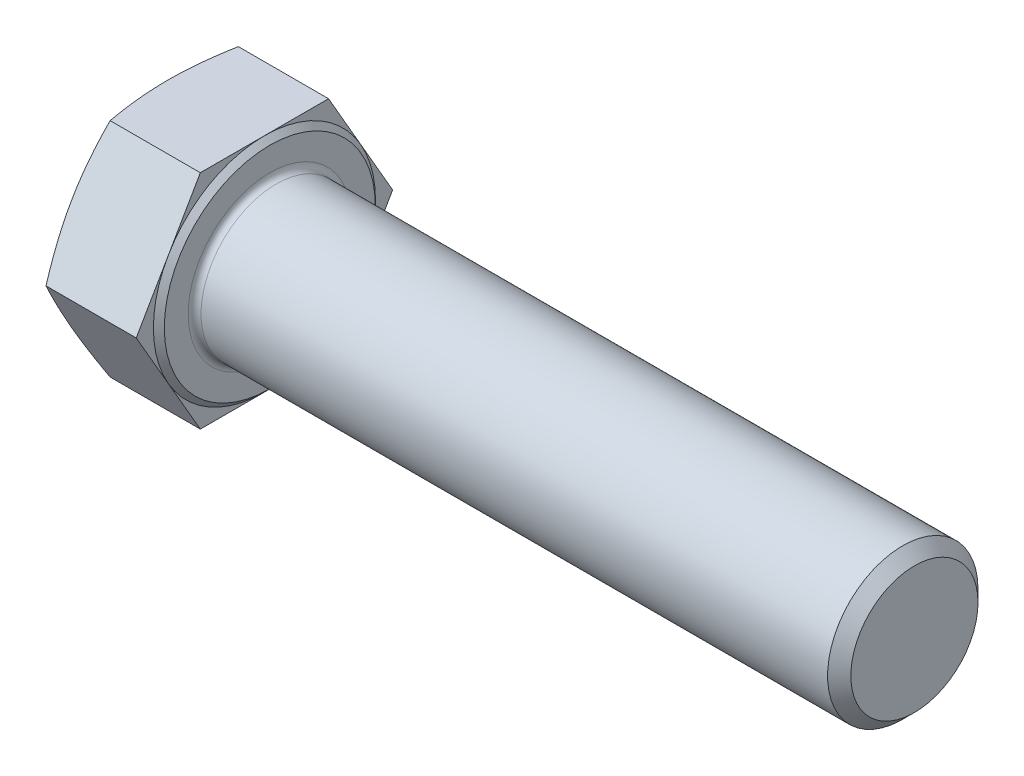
ISO-10303-21;
HEADER;
FILE_DESCRIPTION(('STEP AP214'),'2;1');
FILE_NAME('part.step','',(''),(''),'','','');
FILE_SCHEMA(('AUTOMOTIVE_DESIGN { 1 0 10303 214 1 1 1 1 }'));
ENDSEC;
DATA;
#1=APPLICATION_CONTEXT('core data for automotive mechanical design processes');
#2=APPLICATION_PROTOCOL_DEFINITION('international standard','automotive_design',2000,#1);
#3=PRODUCT_CONTEXT('',#1,'mechanical');
#4=PRODUCT('Part','Part','',(#3));
#5=PRODUCT_RELATED_PRODUCT_CATEGORY('part','',(#4));
#6=PRODUCT_DEFINITION_FORMATION('','',#4);
#7=PRODUCT_DEFINITION_CONTEXT('part definition',#1,'design');
#8=PRODUCT_DEFINITION('design','',#6,#7);
#9=PRODUCT_DEFINITION_SHAPE('','',#8);
#10=(LENGTH_UNIT() NAMED_UNIT(*) SI_UNIT(.MILLI.,.METRE.));
#11=(NAMED_UNIT(*) PLANE_ANGLE_UNIT() SI_UNIT($,.RADIAN.));
#12=(NAMED_UNIT(*) SI_UNIT($,.STERADIAN.) SOLID_ANGLE_UNIT());
#13=UNCERTAINTY_MEASURE_WITH_UNIT(LENGTH_MEASURE(1.E-05),#10,'distance_accuracy_value','');
#14=(GEOMETRIC_REPRESENTATION_CONTEXT(3) GLOBAL_UNCERTAINTY_ASSIGNED_CONTEXT((#13)) GLOBAL_UNIT_ASSIGNED_CONTEXT((#10,
#11,#12)) REPRESENTATION_CONTEXT('',''));
#15=CARTESIAN_POINT('',(0.,0.,0.));
#16=DIRECTION('',(0.,0.,1.));
#17=DIRECTION('',(1.,0.,0.));
#18=AXIS2_PLACEMENT_3D('',#15,#16,#17);
#19=CARTESIAN_POINT('',(9.48,0.,0.));
#20=DIRECTION('',(1.,0.,0.));
#21=DIRECTION('',(0.,0.,-1.));
#22=AXIS2_PLACEMENT_3D('',#19,#20,#21);
#23=PLANE('',#22);
#24=CARTESIAN_POINT('',(9.48,0.,0.));
#25=DIRECTION('',(1.,0.,0.));
#26=DIRECTION('',(0.,0.,-1.));
#27=AXIS2_PLACEMENT_3D('',#24,#25,#26);
#28=CIRCLE('',#27,7.6);
#29=CARTESIAN_POINT('',(9.48,0.,-7.6));
#30=VERTEX_POINT('',#29);
#31=EDGE_CURVE('E188',#30,#30,#28,.F.);
#32=ORIENTED_EDGE('',*,*,#31,.T.);
#33=EDGE_LOOP('',(#32));
#34=FACE_BOUND('',#33,.T.);
#35=CARTESIAN_POINT('',(9.48000000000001,0.,0.));
#36=DIRECTION('',(-1.,0.,0.));
#37=DIRECTION('',(0.,0.,1.));
#38=AXIS2_PLACEMENT_3D('',#35,#36,#37);
#39=CIRCLE('',#38,9.82);
#40=CARTESIAN_POINT('',(9.48000000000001,0.,9.82));
#41=VERTEX_POINT('',#40);
#42=EDGE_CURVE('E138',#41,#41,#39,.T.);
#43=ORIENTED_EDGE('',*,*,#42,.F.);
#44=EDGE_LOOP('',(#43));
#45=FACE_BOUND('',#44,.T.);
#46=ADVANCED_FACE('F33',(#34,#45),#23,.T.);
#47=CARTESIAN_POINT('',(8.98,-20.67,0.));
#48=DIRECTION('',(-1.,0.,0.));
#49=DIRECTION('',(0.,0.,1.));
#50=AXIS2_PLACEMENT_3D('',#47,#48,#49);
#51=PLANE('',#50);
#52=DIRECTION('',(0.,-0.866025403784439,0.5));
#53=VECTOR('',#52,1.);
#54=CARTESIAN_POINT('',(8.98,10.335,5.96691503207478));
#55=LINE('',#54,#53);
#56=CARTESIAN_POINT('',(8.98,10.335,5.96691503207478));
#57=VERTEX_POINT('',#56);
#58=CARTESIAN_POINT('',(8.98,5.1675,8.95037254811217));
#59=VERTEX_POINT('',#58);
#60=EDGE_CURVE('E137',#57,#59,#55,.T.);
#61=ORIENTED_EDGE('',*,*,#60,.T.);
#62=CARTESIAN_POINT('',(8.98,0.,0.));
#63=DIRECTION('',(-1.,0.,0.));
#64=DIRECTION('',(0.,0.,1.));
#65=AXIS2_PLACEMENT_3D('',#62,#63,#64);
#66=CIRCLE('',#65,10.335);
#67=CARTESIAN_POINT('',(8.98,10.335,0.));
#68=VERTEX_POINT('',#67);
#69=EDGE_CURVE('E49',#59,#68,#66,.T.);
#70=ORIENTED_EDGE('',*,*,#69,.T.);
#71=DIRECTION('',(0.,0.,1.));
#72=VECTOR('',#71,1.);
#73=CARTESIAN_POINT('',(8.98,10.335,-5.96691503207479));
#74=LINE('',#73,#72);
#75=EDGE_CURVE('E134',#68,#57,#74,.T.);
#76=ORIENTED_EDGE('',*,*,#75,.T.);
#77=EDGE_LOOP('',(#61,#70,#76));
#78=FACE_BOUND('',#77,.T.);
#79=ADVANCED_FACE('F133',(#78),#51,.F.);
#80=CARTESIAN_POINT('',(8.98,10.335,-5.96691503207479));
#81=VERTEX_POINT('',#80);
#82=EDGE_CURVE('E145',#81,#68,#74,.T.);
#83=ORIENTED_EDGE('',*,*,#82,.T.);
#84=CARTESIAN_POINT('',(8.98,5.1675,-8.95037254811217));
#85=VERTEX_POINT('',#84);
#86=EDGE_CURVE('E121',#68,#85,#66,.T.);
#87=ORIENTED_EDGE('',*,*,#86,.T.);
#88=DIRECTION('',(0.,0.866025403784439,0.5));
#89=VECTOR('',#88,1.);
#90=CARTESIAN_POINT('',(8.98,0.,-11.9338300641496));
#91=LINE('',#90,#89);
#92=EDGE_CURVE('E151',#85,#81,#91,.T.);
#93=ORIENTED_EDGE('',*,*,#92,.T.);
#94=EDGE_LOOP('',(#83,#87,#93));
#95=FACE_BOUND('',#94,.T.);
#96=ADVANCED_FACE('F150',(#95),#51,.F.);
#97=CARTESIAN_POINT('',(8.98,0.,-11.9338300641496));
#98=VERTEX_POINT('',#97);
#99=EDGE_CURVE('E148',#98,#85,#91,.T.);
#100=ORIENTED_EDGE('',*,*,#99,.T.);
#101=CARTESIAN_POINT('',(8.98,-5.1675,-8.95037254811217));
#102=VERTEX_POINT('',#101);
#103=EDGE_CURVE('E124',#85,#102,#66,.T.);
#104=ORIENTED_EDGE('',*,*,#103,.T.);
#105=DIRECTION('',(0.,0.866025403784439,-0.5));
#106=VECTOR('',#105,1.);
#107=CARTESIAN_POINT('',(8.98,-10.335,-5.96691503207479));
#108=LINE('',#107,#106);
#109=EDGE_CURVE('E348',#102,#98,#108,.T.);
#110=ORIENTED_EDGE('',*,*,#109,.T.);
#111=EDGE_LOOP('',(#100,#104,#110));
#112=FACE_BOUND('',#111,.T.);
#113=ADVANCED_FACE('F302',(#112),#51,.F.);
#114=CARTESIAN_POINT('',(8.98,-10.335,-5.96691503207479));
#115=VERTEX_POINT('',#114);
#116=EDGE_CURVE('E316',#115,#102,#108,.T.);
#117=ORIENTED_EDGE('',*,*,#116,.T.);
#118=CARTESIAN_POINT('',(8.98,-10.335,0.));
#119=VERTEX_POINT('',#118);
#120=EDGE_CURVE('E317',#102,#119,#66,.T.);
#121=ORIENTED_EDGE('',*,*,#120,.T.);
#122=DIRECTION('',(0.,0.,-1.));
#123=VECTOR('',#122,1.);
#124=CARTESIAN_POINT('',(8.98,-10.335,5.96691503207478));
#125=LINE('',#124,#123);
#126=EDGE_CURVE('E162',#119,#115,#125,.T.);
#127=ORIENTED_EDGE('',*,*,#126,.T.);
#128=EDGE_LOOP('',(#117,#121,#127));
#129=FACE_BOUND('',#128,.T.);
#130=ADVANCED_FACE('F295',(#129),#51,.F.);
#131=CARTESIAN_POINT('',(8.98,-10.335,5.96691503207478));
#132=VERTEX_POINT('',#131);
#133=EDGE_CURVE('E163',#132,#119,#125,.T.);
#134=ORIENTED_EDGE('',*,*,#133,.T.);
#135=CARTESIAN_POINT('',(8.98,-5.16750000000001,8.95037254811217));
#136=VERTEX_POINT('',#135);
#137=EDGE_CURVE('E306',#119,#136,#66,.T.);
#138=ORIENTED_EDGE('',*,*,#137,.T.);
#139=DIRECTION('',(0.,-0.866025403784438,-0.5));
#140=VECTOR('',#139,1.);
#141=CARTESIAN_POINT('',(8.98,0.,11.9338300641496));
#142=LINE('',#141,#140);
#143=EDGE_CURVE('E158',#136,#132,#142,.T.);
#144=ORIENTED_EDGE('',*,*,#143,.T.);
#145=EDGE_LOOP('',(#134,#138,#144));
#146=FACE_BOUND('',#145,.T.);
#147=ADVANCED_FACE('F287',(#146),#51,.F.);
#148=CARTESIAN_POINT('',(8.98,-10.335,-5.96691503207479));
#149=DIRECTION('',(0.,0.5,0.866025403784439));
#150=DIRECTION('',(0.,-0.866025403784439,0.5));
#151=AXIS2_PLACEMENT_3D('',#148,#149,#150);
#152=PLANE('',#151);
#153=CARTESIAN_POINT('',(0.581968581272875,0.000200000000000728,-11.9339455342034));
#154=CARTESIAN_POINT('',(0.491994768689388,-0.427811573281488,-11.6868329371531));
#155=CARTESIAN_POINT('',(0.410148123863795,-0.857234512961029,-11.4389054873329));
#156=CARTESIAN_POINT('',(0.266151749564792,-1.7188724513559,-10.9414385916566));
#157=CARTESIAN_POINT('',(0.204017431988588,-2.15108936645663,-10.6918980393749));
#158=CARTESIAN_POINT('',(0.103517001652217,-3.01351880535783,-10.1939741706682));
#159=CARTESIAN_POINT('',(0.0649316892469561,-3.44371163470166,-9.94560222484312));
#160=CARTESIAN_POINT('',(0.0131779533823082,-4.30510326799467,-9.44827753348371));
#161=CARTESIAN_POINT('',(0.,-4.73630163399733,-9.19932504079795));
#162=CARTESIAN_POINT('',(0.,-5.59869836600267,-8.70142005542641));
#163=CARTESIAN_POINT('',(0.0131779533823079,-6.02989673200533,-8.45246756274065));
#164=CARTESIAN_POINT('',(0.0649316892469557,-6.89128836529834,-7.95514287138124));
#165=CARTESIAN_POINT('',(0.103517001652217,-7.32148119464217,-7.70677092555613));
#166=CARTESIAN_POINT('',(0.204017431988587,-8.18391063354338,-7.20884705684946));
#167=CARTESIAN_POINT('',(0.266151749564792,-8.61612754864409,-6.95930650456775));
#168=CARTESIAN_POINT('',(0.410148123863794,-9.47776548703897,-6.46183960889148));
#169=CARTESIAN_POINT('',(0.491994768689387,-9.90718842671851,-6.21391215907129));
#170=CARTESIAN_POINT('',(0.581968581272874,-10.3352,-5.96679956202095));
#171=B_SPLINE_CURVE_WITH_KNOTS('',3,(#153,#154,#155,#156,#157,#158,#159,#160,#161,#162,#163,
#164,#165,#166,#167,#168,#169,#170),.UNSPECIFIED.,.F.,.F.,(4,2,2,2,2,2,2,2,4),(0.,
1.50720038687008,3.01557627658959,4.50968874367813,6.00324068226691,7.49679262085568,
8.99090508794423,10.4992809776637,12.0064813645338),.UNSPECIFIED.);
#172=CARTESIAN_POINT('',(0.581926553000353,0.,-11.9338300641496));
#173=VERTEX_POINT('',#172);
#174=CARTESIAN_POINT('',(0.,-5.1675,-8.95037254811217));
#175=VERTEX_POINT('',#174);
#176=EDGE_CURVE('E332',#173,#175,#171,.T.);
#177=ORIENTED_EDGE('',*,*,#176,.F.);
#178=DIRECTION('',(-1.,0.,0.));
#179=VECTOR('',#178,1.);
#180=CARTESIAN_POINT('',(8.98,0.,-11.9338300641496));
#181=LINE('',#180,#179);
#182=EDGE_CURVE('E178',#98,#173,#181,.T.);
#183=ORIENTED_EDGE('',*,*,#182,.F.);
#184=ORIENTED_EDGE('',*,*,#109,.F.);
#185=ORIENTED_EDGE('',*,*,#116,.F.);
#186=DIRECTION('',(-1.,0.,0.));
#187=VECTOR('',#186,1.);
#188=CARTESIAN_POINT('',(8.98,-10.335,-5.96691503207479));
#189=LINE('',#188,#187);
#190=CARTESIAN_POINT('',(0.581926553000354,-10.335,-5.9669150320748));
#191=VERTEX_POINT('',#190);
#192=EDGE_CURVE('E166',#115,#191,#189,.T.);
#193=ORIENTED_EDGE('',*,*,#192,.T.);
#194=EDGE_CURVE('E245',#175,#191,#171,.T.);
#195=ORIENTED_EDGE('',*,*,#194,.F.);
#196=EDGE_LOOP('',(#177,#183,#184,#185,#193,#195));
#197=FACE_BOUND('',#196,.T.);
#198=ADVANCED_FACE('F35',(#197),#152,.F.);
#199=CARTESIAN_POINT('',(8.98,0.,-11.9338300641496));
#200=DIRECTION('',(0.,-0.5,0.866025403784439));
#201=DIRECTION('',(0.,-0.866025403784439,-0.5));
#202=AXIS2_PLACEMENT_3D('',#199,#200,#201);
#203=PLANE('',#202);
#204=CARTESIAN_POINT('',(0.581968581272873,10.3352,-5.96679956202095));
#205=CARTESIAN_POINT('',(0.491994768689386,9.90718842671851,-6.21391215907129));
#206=CARTESIAN_POINT('',(0.410148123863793,9.47776548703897,-6.46183960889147));
#207=CARTESIAN_POINT('',(0.266151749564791,8.61612754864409,-6.95930650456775));
#208=CARTESIAN_POINT('',(0.204017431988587,8.18391063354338,-7.20884705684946));
#209=CARTESIAN_POINT('',(0.103517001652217,7.32148119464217,-7.70677092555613));
#210=CARTESIAN_POINT('',(0.0649316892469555,6.89128836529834,-7.95514287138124));
#211=CARTESIAN_POINT('',(0.0131779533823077,6.02989673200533,-8.45246756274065));
#212=CARTESIAN_POINT('',(0.,5.59869836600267,-8.70142005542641));
#213=CARTESIAN_POINT('',(0.,4.73630163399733,-9.19932504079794));
#214=CARTESIAN_POINT('',(0.0131779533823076,4.30510326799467,-9.44827753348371));
#215=CARTESIAN_POINT('',(0.0649316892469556,3.44371163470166,-9.94560222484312));
#216=CARTESIAN_POINT('',(0.103517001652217,3.01351880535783,-10.1939741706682));
#217=CARTESIAN_POINT('',(0.204017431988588,2.15108936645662,-10.6918980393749));
#218=CARTESIAN_POINT('',(0.266151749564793,1.7188724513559,-10.9414385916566));
#219=CARTESIAN_POINT('',(0.410148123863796,0.857234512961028,-11.4389054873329));
#220=CARTESIAN_POINT('',(0.491994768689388,0.427811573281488,-11.6868329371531));
#221=CARTESIAN_POINT('',(0.581968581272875,-0.000200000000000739,-11.9339455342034));
#222=B_SPLINE_CURVE_WITH_KNOTS('',3,(#204,#205,#206,#207,#208,#209,#210,#211,#212,#213,#214,
#215,#216,#217,#218,#219,#220,#221),.UNSPECIFIED.,.F.,.F.,(4,2,2,2,2,2,2,2,4),(0.,
1.50720038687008,3.01557627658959,4.50968874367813,6.00324068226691,7.49679262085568,
8.99090508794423,10.4992809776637,12.0064813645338),.UNSPECIFIED.);
#223=CARTESIAN_POINT('',(0.581926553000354,10.335,-5.9669150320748));
#224=VERTEX_POINT('',#223);
#225=CARTESIAN_POINT('',(0.,5.16750000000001,-8.95037254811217));
#226=VERTEX_POINT('',#225);
#227=EDGE_CURVE('E260',#224,#226,#222,.T.);
#228=ORIENTED_EDGE('',*,*,#227,.F.);
#229=DIRECTION('',(-1.,0.,0.));
#230=VECTOR('',#229,1.);
#231=CARTESIAN_POINT('',(8.98,10.335,-5.96691503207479));
#232=LINE('',#231,#230);
#233=EDGE_CURVE('E176',#81,#224,#232,.T.);
#234=ORIENTED_EDGE('',*,*,#233,.F.);
#235=ORIENTED_EDGE('',*,*,#92,.F.);
#236=ORIENTED_EDGE('',*,*,#99,.F.);
#237=ORIENTED_EDGE('',*,*,#182,.T.);
#238=EDGE_CURVE('E256',#226,#173,#222,.T.);
#239=ORIENTED_EDGE('',*,*,#238,.F.);
#240=EDGE_LOOP('',(#228,#234,#235,#236,#237,#239));
#241=FACE_BOUND('',#240,.T.);
#242=ADVANCED_FACE('F266',(#241),#203,.F.);
#243=CARTESIAN_POINT('',(8.98,10.335,-5.96691503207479));
#244=DIRECTION('',(0.,-1.,0.));
#245=DIRECTION('',(0.,0.,-1.));
#246=AXIS2_PLACEMENT_3D('',#243,#244,#245);
#247=PLANE('',#246);
#248=CARTESIAN_POINT('',(3.10958471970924,10.335,-15.798292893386));
#249=CARTESIAN_POINT('',(2.96720289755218,10.335,-15.3307001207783));
#250=CARTESIAN_POINT('',(2.82648248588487,10.335,-14.862592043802));
#251=CARTESIAN_POINT('',(2.5492835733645,10.335,-13.9250829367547));
#252=CARTESIAN_POINT('',(2.4128054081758,10.335,-13.4556818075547));
#253=CARTESIAN_POINT('',(2.14478304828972,10.335,-12.5145208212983));
#254=CARTESIAN_POINT('',(2.01324853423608,10.335,-12.0427581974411));
#255=CARTESIAN_POINT('',(1.75665338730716,10.335,-11.0974780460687));
#256=CARTESIAN_POINT('',(1.63159263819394,10.335,-10.6239605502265));
#257=CARTESIAN_POINT('',(1.39104046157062,10.335,-9.68070641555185));
#258=CARTESIAN_POINT('',(1.27545006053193,10.335,-9.21099514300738));
#259=CARTESIAN_POINT('',(1.05411039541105,10.335,-8.26923525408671));
#260=CARTESIAN_POINT('',(0.948361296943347,10.335,-7.79718659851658));
#261=CARTESIAN_POINT('',(0.74916967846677,10.335,-6.85064631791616));
#262=CARTESIAN_POINT('',(0.655722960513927,10.335,-6.37615558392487));
#263=CARTESIAN_POINT('',(0.483981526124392,10.335,-5.42441936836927));
#264=CARTESIAN_POINT('',(0.405686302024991,10.335,-4.94717397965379));
#265=CARTESIAN_POINT('',(0.275180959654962,10.335,-4.04366815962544));
#266=CARTESIAN_POINT('',(0.221030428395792,10.335,-3.61769064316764));
#267=CARTESIAN_POINT('',(0.129366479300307,10.335,-2.7639343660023));
#268=CARTESIAN_POINT('',(0.091852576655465,10.335,-2.3361556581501));
#269=CARTESIAN_POINT('',(0.0352684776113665,10.335,-1.47966469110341));
#270=CARTESIAN_POINT('',(0.0161852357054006,10.335,-1.05095330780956));
#271=CARTESIAN_POINT('',(-0.00257136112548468,10.335,-0.193101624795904));
#272=CARTESIAN_POINT('',(-0.00224485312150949,10.335,0.236038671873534));
#273=CARTESIAN_POINT('',(0.0178511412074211,10.335,1.09603379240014));
#274=CARTESIAN_POINT('',(0.0377192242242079,10.335,1.52688627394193));
#275=CARTESIAN_POINT('',(0.0959840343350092,10.335,2.38732571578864));
#276=CARTESIAN_POINT('',(0.134381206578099,10.335,2.81691264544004));
#277=CARTESIAN_POINT('',(0.227907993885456,10.335,3.67460886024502));
#278=CARTESIAN_POINT('',(0.283051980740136,10.335,4.10271655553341));
#279=CARTESIAN_POINT('',(0.407835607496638,10.335,4.95679022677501));
#280=CARTESIAN_POINT('',(0.477475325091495,10.335,5.3827561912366));
#281=CARTESIAN_POINT('',(0.6329912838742,10.335,6.25496163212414));
#282=CARTESIAN_POINT('',(0.719531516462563,10.335,6.70108166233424));
#283=CARTESIAN_POINT('',(0.903750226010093,10.335,7.59103079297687));
#284=CARTESIAN_POINT('',(1.00142954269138,10.335,8.03485971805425));
#285=CARTESIAN_POINT('',(1.20587534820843,10.335,8.92054290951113));
#286=CARTESIAN_POINT('',(1.31264447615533,10.335,9.36239656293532));
#287=CARTESIAN_POINT('',(1.53353310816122,10.335,10.2442425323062));
#288=CARTESIAN_POINT('',(1.64765243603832,10.335,10.6842348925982));
#289=CARTESIAN_POINT('',(1.88201785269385,10.335,11.5631842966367));
#290=CARTESIAN_POINT('',(2.00227162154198,10.335,12.0021392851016));
#291=CARTESIAN_POINT('',(2.24767123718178,10.335,12.8786777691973));
#292=CARTESIAN_POINT('',(2.37281710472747,10.335,13.3162612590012));
#293=CARTESIAN_POINT('',(2.6271036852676,10.335,14.1901818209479));
#294=CARTESIAN_POINT('',(2.75624370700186,10.335,14.6265190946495));
#295=CARTESIAN_POINT('',(3.01785091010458,10.335,15.4981962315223));
#296=CARTESIAN_POINT('',(3.15031811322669,10.335,15.9335360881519));
#297=CARTESIAN_POINT('',(3.54889373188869,10.335,17.2286737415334));
#298=CARTESIAN_POINT('',(3.819012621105,10.335,18.0872370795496));
#299=CARTESIAN_POINT('',(4.36690503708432,10.335,19.8019507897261));
#300=CARTESIAN_POINT('',(4.64467893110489,10.335,20.6581010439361));
#301=CARTESIAN_POINT('',(5.20477544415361,10.335,22.3653125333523));
#302=CARTESIAN_POINT('',(5.48707680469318,10.335,23.2163807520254));
#303=CARTESIAN_POINT('',(5.91366040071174,10.335,24.491894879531));
#304=CARTESIAN_POINT('',(6.05637104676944,10.335,24.9168677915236));
#305=CARTESIAN_POINT('',(6.34271577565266,10.335,25.7665012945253));
#306=CARTESIAN_POINT('',(6.48634985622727,10.335,26.1911618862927));
#307=CARTESIAN_POINT('',(6.63038397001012,10.335,26.6156868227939));
#308=B_SPLINE_CURVE_WITH_KNOTS('',3,(#248,#249,#250,#251,#252,#253,#254,#255,#256,#257,#258,
#259,#260,#261,#262,#263,#264,#265,#266,#267,#268,#269,#270,#271,#272,#273,#274,#275,#276,#277,
#278,#279,#280,#281,#282,#283,#284,#285,#286,#287,#288,#289,#290,#291,#292,#293,#294,#295,#296,
#297,#298,#299,#300,#301,#302,#303,#304,#305,#306,#307),.UNSPECIFIED.,.F.,.F.,(4,2,2,2,2,2,2,2,
2,2,2,2,2,2,2,2,2,2,2,2,2,2,2,2,2,2,2,2,2,4),(0.,1.46638014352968,2.93287601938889,
4.40210801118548,5.87131361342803,7.32240467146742,8.77352014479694,10.22413916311,
11.6747095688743,12.9626433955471,14.2505396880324,15.5375237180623,16.8244986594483,
18.1180004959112,19.4115334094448,20.7061795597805,22.0008326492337,23.3639670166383,
24.7272042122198,26.0908385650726,27.4544402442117,28.8197931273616,30.1851518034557,
31.5502754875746,32.9154080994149,35.6155084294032,38.3157385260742,41.0057230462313,
42.3506069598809,43.6954875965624),.UNSPECIFIED.);
#309=CARTESIAN_POINT('',(0.581926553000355,10.335,5.96691503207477));
#310=VERTEX_POINT('',#309);
#311=CARTESIAN_POINT('',(0.,10.335,0.));
#312=VERTEX_POINT('',#311);
#313=EDGE_CURVE('E349',#310,#312,#308,.F.);
#314=ORIENTED_EDGE('',*,*,#313,.F.);
#315=DIRECTION('',(-1.,0.,0.));
#316=VECTOR('',#315,1.);
#317=CARTESIAN_POINT('',(8.98,10.335,5.96691503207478));
#318=LINE('',#317,#316);
#319=EDGE_CURVE('E147',#57,#310,#318,.T.);
#320=ORIENTED_EDGE('',*,*,#319,.F.);
#321=ORIENTED_EDGE('',*,*,#75,.F.);
#322=ORIENTED_EDGE('',*,*,#82,.F.);
#323=ORIENTED_EDGE('',*,*,#233,.T.);
#324=EDGE_CURVE('E261',#312,#224,#308,.F.);
#325=ORIENTED_EDGE('',*,*,#324,.F.);
#326=EDGE_LOOP('',(#314,#320,#321,#322,#323,#325));
#327=FACE_BOUND('',#326,.T.);
#328=ADVANCED_FACE('F143',(#327),#247,.F.);
#329=CARTESIAN_POINT('',(8.98,10.335,5.96691503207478));
#330=DIRECTION('',(0.,-0.5,-0.866025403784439));
#331=DIRECTION('',(0.,0.866025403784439,-0.5));
#332=AXIS2_PLACEMENT_3D('',#329,#330,#331);
#333=PLANE('',#332);
#334=CARTESIAN_POINT('',(0.581968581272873,-0.000199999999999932,11.9339455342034));
#335=CARTESIAN_POINT('',(0.491994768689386,0.427811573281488,11.6868329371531));
#336=CARTESIAN_POINT('',(0.410148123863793,0.857234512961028,11.4389054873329));
#337=CARTESIAN_POINT('',(0.26615174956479,1.7188724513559,10.9414385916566));
#338=CARTESIAN_POINT('',(0.204017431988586,2.15108936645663,10.6918980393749));
#339=CARTESIAN_POINT('',(0.103517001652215,3.01351880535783,10.1939741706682));
#340=CARTESIAN_POINT('',(0.0649316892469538,3.44371163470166,9.94560222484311));
#341=CARTESIAN_POINT('',(0.0131779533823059,4.30510326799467,9.4482775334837));
#342=CARTESIAN_POINT('',(0.,4.73630163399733,9.19932504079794));
#343=CARTESIAN_POINT('',(0.,5.59869836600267,8.7014200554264));
#344=CARTESIAN_POINT('',(0.0131779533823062,6.02989673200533,8.45246756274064));
#345=CARTESIAN_POINT('',(0.064931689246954,6.89128836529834,7.95514287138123));
#346=CARTESIAN_POINT('',(0.103517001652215,7.32148119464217,7.70677092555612));
#347=CARTESIAN_POINT('',(0.204017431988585,8.18391063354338,7.20884705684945));
#348=CARTESIAN_POINT('',(0.26615174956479,8.6161275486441,6.95930650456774));
#349=CARTESIAN_POINT('',(0.410148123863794,9.47776548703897,6.46183960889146));
#350=CARTESIAN_POINT('',(0.491994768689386,9.90718842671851,6.21391215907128));
#351=CARTESIAN_POINT('',(0.581968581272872,10.3352,5.96679956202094));
#352=B_SPLINE_CURVE_WITH_KNOTS('',3,(#334,#335,#336,#337,#338,#339,#340,#341,#342,#343,#344,
#345,#346,#347,#348,#349,#350,#351),.UNSPECIFIED.,.F.,.F.,(4,2,2,2,2,2,2,2,4),(0.,
1.50720038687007,3.01557627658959,4.50968874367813,6.00324068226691,7.49679262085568,
8.99090508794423,10.4992809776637,12.0064813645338),.UNSPECIFIED.);
#353=CARTESIAN_POINT('',(0.581926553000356,0.,11.9338300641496));
#354=VERTEX_POINT('',#353);
#355=CARTESIAN_POINT('',(0.,5.1675,8.95037254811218));
#356=VERTEX_POINT('',#355);
#357=EDGE_CURVE('E250',#354,#356,#352,.T.);
#358=ORIENTED_EDGE('',*,*,#357,.F.);
#359=DIRECTION('',(-1.,0.,0.));
#360=VECTOR('',#359,1.);
#361=CARTESIAN_POINT('',(8.98,0.,11.9338300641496));
#362=LINE('',#361,#360);
#363=CARTESIAN_POINT('',(8.98,0.,11.9338300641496));
#364=VERTEX_POINT('',#363);
#365=EDGE_CURVE('E172',#364,#354,#362,.T.);
#366=ORIENTED_EDGE('',*,*,#365,.F.);
#367=EDGE_CURVE('E153',#59,#364,#55,.T.);
#368=ORIENTED_EDGE('',*,*,#367,.F.);
#369=ORIENTED_EDGE('',*,*,#60,.F.);
#370=ORIENTED_EDGE('',*,*,#319,.T.);
#371=EDGE_CURVE('E335',#356,#310,#352,.T.);
#372=ORIENTED_EDGE('',*,*,#371,.F.);
#373=EDGE_LOOP('',(#358,#366,#368,#369,#370,#372));
#374=FACE_BOUND('',#373,.T.);
#375=ADVANCED_FACE('F272',(#374),#333,.F.);
#376=CARTESIAN_POINT('',(8.98,0.,11.9338300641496));
#377=DIRECTION('',(0.,0.5,-0.866025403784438));
#378=DIRECTION('',(0.,0.866025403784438,0.5));
#379=AXIS2_PLACEMENT_3D('',#376,#377,#378);
#380=PLANE('',#379);
#381=CARTESIAN_POINT('',(0.581968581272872,-10.3352,5.96679956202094));
#382=CARTESIAN_POINT('',(0.491994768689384,-9.90718842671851,6.21391215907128));
#383=CARTESIAN_POINT('',(0.410148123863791,-9.47776548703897,6.46183960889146));
#384=CARTESIAN_POINT('',(0.266151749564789,-8.61612754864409,6.95930650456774));
#385=CARTESIAN_POINT('',(0.204017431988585,-8.18391063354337,7.20884705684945));
#386=CARTESIAN_POINT('',(0.103517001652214,-7.32148119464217,7.70677092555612));
#387=CARTESIAN_POINT('',(0.0649316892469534,-6.89128836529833,7.95514287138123));
#388=CARTESIAN_POINT('',(0.0131779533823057,-6.02989673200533,8.45246756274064));
#389=CARTESIAN_POINT('',(0.,-5.59869836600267,8.7014200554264));
#390=CARTESIAN_POINT('',(0.,-4.73630163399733,9.19932504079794));
#391=CARTESIAN_POINT('',(0.0131779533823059,-4.30510326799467,9.4482775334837));
#392=CARTESIAN_POINT('',(0.0649316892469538,-3.44371163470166,9.94560222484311));
#393=CARTESIAN_POINT('',(0.103517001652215,-3.01351880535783,10.1939741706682));
#394=CARTESIAN_POINT('',(0.204017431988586,-2.15108936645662,10.6918980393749));
#395=CARTESIAN_POINT('',(0.266151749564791,-1.7188724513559,10.9414385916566));
#396=CARTESIAN_POINT('',(0.410148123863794,-0.857234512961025,11.4389054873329));
#397=CARTESIAN_POINT('',(0.491994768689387,-0.427811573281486,11.6868329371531));
#398=CARTESIAN_POINT('',(0.581968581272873,0.000200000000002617,11.9339455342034));
#399=B_SPLINE_CURVE_WITH_KNOTS('',3,(#381,#382,#383,#384,#385,#386,#387,#388,#389,#390,#391,
#392,#393,#394,#395,#396,#397,#398),.UNSPECIFIED.,.F.,.F.,(4,2,2,2,2,2,2,2,4),(0.,
1.50720038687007,3.01557627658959,4.50968874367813,6.00324068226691,7.49679262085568,
8.99090508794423,10.4992809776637,12.0064813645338),.UNSPECIFIED.);
#400=CARTESIAN_POINT('',(0.581926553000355,-10.335,5.96691503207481));
#401=VERTEX_POINT('',#400);
#402=CARTESIAN_POINT('',(0.,-5.16750000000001,8.95037254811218));
#403=VERTEX_POINT('',#402);
#404=EDGE_CURVE('E238',#401,#403,#399,.T.);
#405=ORIENTED_EDGE('',*,*,#404,.F.);
#406=DIRECTION('',(-1.,0.,0.));
#407=VECTOR('',#406,1.);
#408=CARTESIAN_POINT('',(8.98,-10.335,5.96691503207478));
#409=LINE('',#408,#407);
#410=EDGE_CURVE('E169',#132,#401,#409,.T.);
#411=ORIENTED_EDGE('',*,*,#410,.F.);
#412=ORIENTED_EDGE('',*,*,#143,.F.);
#413=EDGE_CURVE('E159',#364,#136,#142,.T.);
#414=ORIENTED_EDGE('',*,*,#413,.F.);
#415=ORIENTED_EDGE('',*,*,#365,.T.);
#416=EDGE_CURVE('E330',#403,#354,#399,.T.);
#417=ORIENTED_EDGE('',*,*,#416,.F.);
#418=EDGE_LOOP('',(#405,#411,#412,#414,#415,#417));
#419=FACE_BOUND('',#418,.T.);
#420=ADVANCED_FACE('F275',(#419),#380,.F.);
#421=CARTESIAN_POINT('',(8.98,-10.335,5.96691503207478));
#422=DIRECTION('',(0.,1.,0.));
#423=DIRECTION('',(0.,0.,1.));
#424=AXIS2_PLACEMENT_3D('',#421,#422,#423);
#425=PLANE('',#424);
#426=CARTESIAN_POINT('',(3.10958527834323,-10.335,-15.7982947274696));
#427=CARTESIAN_POINT('',(2.96720342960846,-10.335,-15.3307018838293));
#428=CARTESIAN_POINT('',(2.82648299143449,-10.335,-14.8625937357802));
#429=CARTESIAN_POINT('',(2.54928402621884,-10.335,-13.9250844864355));
#430=CARTESIAN_POINT('',(2.41280583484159,-10.335,-13.4556832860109));
#431=CARTESIAN_POINT('',(2.14478342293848,-10.335,-12.5145221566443));
#432=CARTESIAN_POINT('',(2.01324888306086,-10.335,-12.0427594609));
#433=CARTESIAN_POINT('',(1.7566536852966,-10.335,-11.0974791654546));
#434=CARTESIAN_POINT('',(1.63159291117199,-10.335,-10.6239615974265));
#435=CARTESIAN_POINT('',(1.39104068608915,-10.335,-9.68070731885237));
#436=CARTESIAN_POINT('',(1.2754502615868,-10.335,-9.21099597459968));
#437=CARTESIAN_POINT('',(1.05411055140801,-10.335,-8.26923594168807));
#438=CARTESIAN_POINT('',(0.948361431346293,-10.335,-7.79718721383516));
#439=CARTESIAN_POINT('',(0.749169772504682,-10.335,-6.85064678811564));
#440=CARTESIAN_POINT('',(0.655723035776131,-10.335,-6.37615598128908));
#441=CARTESIAN_POINT('',(0.483981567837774,-10.335,-5.42441961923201));
#442=CARTESIAN_POINT('',(0.405686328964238,-10.335,-4.94717415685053));
#443=CARTESIAN_POINT('',(0.275180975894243,-10.335,-4.04366828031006));
#444=CARTESIAN_POINT('',(0.221030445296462,-10.335,-3.6176907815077));
#445=CARTESIAN_POINT('',(0.129366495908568,-10.335,-2.76393453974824));
#446=CARTESIAN_POINT('',(0.0918525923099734,-10.335,-2.33615584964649));
#447=CARTESIAN_POINT('',(0.0352684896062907,-10.335,-1.47966491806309));
#448=CARTESIAN_POINT('',(0.0161852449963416,-10.335,-1.05095355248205));
#449=CARTESIAN_POINT('',(-0.00257135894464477,-10.335,-0.193101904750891));
#450=CARTESIAN_POINT('',(-0.00224485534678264,-10.335,0.236038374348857));
#451=CARTESIAN_POINT('',(0.0178511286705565,-10.335,1.09603345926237));
#452=CARTESIAN_POINT('',(0.037719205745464,-10.335,1.52688592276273));
#453=CARTESIAN_POINT('',(0.095984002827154,-10.335,2.38732532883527));
#454=CARTESIAN_POINT('',(0.134381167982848,-10.335,2.81691224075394));
#455=CARTESIAN_POINT('',(0.227907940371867,-10.335,3.67460842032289));
#456=CARTESIAN_POINT('',(0.283051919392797,-10.335,4.10271609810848));
#457=CARTESIAN_POINT('',(0.407835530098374,-10.335,4.95678973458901));
#458=CARTESIAN_POINT('',(0.477475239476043,-10.335,5.38275568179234));
#459=CARTESIAN_POINT('',(0.632991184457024,-10.335,6.25496110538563));
#460=CARTESIAN_POINT('',(0.719531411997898,-10.335,6.70108113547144));
#461=CARTESIAN_POINT('',(0.90375011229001,-10.335,7.59103026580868));
#462=CARTESIAN_POINT('',(1.00142942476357,-10.335,8.03485919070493));
#463=CARTESIAN_POINT('',(1.20587522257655,-10.335,8.92054238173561));
#464=CARTESIAN_POINT('',(1.3126443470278,-10.335,9.3623960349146));
#465=CARTESIAN_POINT('',(1.53353297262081,-10.335,10.2442420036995));
#466=CARTESIAN_POINT('',(1.64765229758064,-10.335,10.6842343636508));
#467=CARTESIAN_POINT('',(1.88201770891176,-10.335,11.5631837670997));
#468=CARTESIAN_POINT('',(2.00227147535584,-10.335,12.0021387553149));
#469=CARTESIAN_POINT('',(2.24767108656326,-10.335,12.8786772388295));
#470=CARTESIAN_POINT('',(2.37281695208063,-10.335,13.316260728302));
#471=CARTESIAN_POINT('',(2.62710352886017,-10.335,14.1901812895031));
#472=CARTESIAN_POINT('',(2.75624354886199,-10.335,14.6265185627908));
#473=CARTESIAN_POINT('',(3.01785074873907,-10.335,15.4981956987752));
#474=CARTESIAN_POINT('',(3.15031795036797,-10.335,15.9335355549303));
#475=CARTESIAN_POINT('',(3.54889356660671,-10.335,17.2286732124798));
#476=CARTESIAN_POINT('',(3.81901245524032,-10.335,18.0872365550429));
#477=CARTESIAN_POINT('',(4.36690487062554,-10.335,19.8019502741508));
#478=CARTESIAN_POINT('',(4.64467876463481,-10.335,20.6581005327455));
#479=CARTESIAN_POINT('',(5.20477527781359,-10.335,22.3653120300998));
#480=CARTESIAN_POINT('',(5.48707663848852,-10.335,23.2163802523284));
#481=CARTESIAN_POINT('',(5.91366023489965,-10.335,24.4918943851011));
#482=CARTESIAN_POINT('',(6.05637088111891,-10.335,24.9168672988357));
#483=CARTESIAN_POINT('',(6.34271561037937,-10.335,25.7665008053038));
#484=CARTESIAN_POINT('',(6.48634969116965,-10.335,26.1911613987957));
#485=CARTESIAN_POINT('',(6.63038380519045,-10.335,26.6156863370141));
#486=B_SPLINE_CURVE_WITH_KNOTS('',3,(#426,#427,#428,#429,#430,#431,#432,#433,#434,#435,#436,
#437,#438,#439,#440,#441,#442,#443,#444,#445,#446,#447,#448,#449,#450,#451,#452,#453,#454,#455,
#456,#457,#458,#459,#460,#461,#462,#463,#464,#465,#466,#467,#468,#469,#470,#471,#472,#473,#474,
#475,#476,#477,#478,#479,#480,#481,#482,#483,#484,#485),.UNSPECIFIED.,.F.,.F.,(4,2,2,2,2,2,2,2,
2,2,2,2,2,2,2,2,2,2,2,2,2,2,2,2,2,2,2,2,2,4),(0.,1.46638037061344,2.93287647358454,
4.40210869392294,5.87131452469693,7.32240580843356,8.7735215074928,10.2241407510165,
11.6747113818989,12.9626451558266,14.250541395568,15.5375253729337,16.8245002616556,
18.1180020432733,19.4115349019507,20.7061809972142,22.0008340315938,23.3639683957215,
24.727205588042,26.0908399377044,27.4544416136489,28.8197944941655,30.185153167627,
31.5502768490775,32.9154094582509,35.6155098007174,38.3157399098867,41.0057244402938,
42.3506083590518,43.6954890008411),.UNSPECIFIED.);
#487=CARTESIAN_POINT('',(0.,-10.335,0.));
#488=VERTEX_POINT('',#487);
#489=EDGE_CURVE('E323',#191,#488,#486,.T.);
#490=ORIENTED_EDGE('',*,*,#489,.F.);
#491=ORIENTED_EDGE('',*,*,#192,.F.);
#492=ORIENTED_EDGE('',*,*,#126,.F.);
#493=ORIENTED_EDGE('',*,*,#133,.F.);
#494=ORIENTED_EDGE('',*,*,#410,.T.);
#495=EDGE_CURVE('E228',#488,#401,#486,.T.);
#496=ORIENTED_EDGE('',*,*,#495,.F.);
#497=EDGE_LOOP('',(#490,#491,#492,#493,#494,#496));
#498=FACE_BOUND('',#497,.T.);
#499=ADVANCED_FACE('F279',(#498),#425,.F.);
#500=ORIENTED_EDGE('',*,*,#413,.T.);
#501=EDGE_CURVE('E139',#136,#59,#66,.T.);
#502=ORIENTED_EDGE('',*,*,#501,.T.);
#503=ORIENTED_EDGE('',*,*,#367,.T.);
#504=EDGE_LOOP('',(#500,#502,#503));
#505=FACE_BOUND('',#504,.T.);
#506=ADVANCED_FACE('F213',(#505),#51,.F.);
#507=CARTESIAN_POINT('',(0.,0.,0.));
#508=DIRECTION('',(1.,0.,0.));
#509=DIRECTION('',(0.,0.,-1.));
#510=AXIS2_PLACEMENT_3D('',#507,#508,#509);
#511=CONICAL_SURFACE('',#510,10.335,1.22173047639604);
#512=ORIENTED_EDGE('',*,*,#357,.T.);
#513=CARTESIAN_POINT('',(0.,0.,0.));
#514=DIRECTION('',(-1.,0.,0.));
#515=DIRECTION('',(0.,0.,1.));
#516=AXIS2_PLACEMENT_3D('',#513,#514,#515);
#517=CIRCLE('',#516,10.335);
#518=EDGE_CURVE('E181',#403,#356,#517,.T.);
#519=ORIENTED_EDGE('',*,*,#518,.F.);
#520=ORIENTED_EDGE('',*,*,#416,.T.);
#521=EDGE_LOOP('',(#512,#519,#520));
#522=FACE_BOUND('',#521,.T.);
#523=ADVANCED_FACE('F285',(#522),#511,.T.);
#524=ORIENTED_EDGE('',*,*,#404,.T.);
#525=EDGE_CURVE('E184',#488,#403,#517,.T.);
#526=ORIENTED_EDGE('',*,*,#525,.F.);
#527=ORIENTED_EDGE('',*,*,#495,.T.);
#528=EDGE_LOOP('',(#524,#526,#527));
#529=FACE_BOUND('',#528,.T.);
#530=ADVANCED_FACE('F224',(#529),#511,.T.);
#531=ORIENTED_EDGE('',*,*,#194,.T.);
#532=ORIENTED_EDGE('',*,*,#489,.T.);
#533=EDGE_CURVE('E344',#175,#488,#517,.T.);
#534=ORIENTED_EDGE('',*,*,#533,.F.);
#535=EDGE_LOOP('',(#531,#532,#534));
#536=FACE_BOUND('',#535,.T.);
#537=ADVANCED_FACE('F292',(#536),#511,.T.);
#538=ORIENTED_EDGE('',*,*,#238,.T.);
#539=ORIENTED_EDGE('',*,*,#176,.T.);
#540=EDGE_CURVE('E340',#226,#175,#517,.T.);
#541=ORIENTED_EDGE('',*,*,#540,.F.);
#542=EDGE_LOOP('',(#538,#539,#541));
#543=FACE_BOUND('',#542,.T.);
#544=ADVANCED_FACE('F293',(#543),#511,.T.);
#545=ORIENTED_EDGE('',*,*,#324,.T.);
#546=ORIENTED_EDGE('',*,*,#227,.T.);
#547=EDGE_CURVE('E185',#312,#226,#517,.T.);
#548=ORIENTED_EDGE('',*,*,#547,.F.);
#549=EDGE_LOOP('',(#545,#546,#548));
#550=FACE_BOUND('',#549,.T.);
#551=ADVANCED_FACE('F223',(#550),#511,.T.);
#552=ORIENTED_EDGE('',*,*,#313,.T.);
#553=CARTESIAN_POINT('',(0.,0.,0.));
#554=DIRECTION('',(-1.,0.,0.));
#555=DIRECTION('',(0.,0.,1.));
#556=AXIS2_PLACEMENT_3D('',#553,#554,#555);
#557=CIRCLE('',#556,10.335);
#558=EDGE_CURVE('E57',#356,#312,#557,.T.);
#559=ORIENTED_EDGE('',*,*,#558,.F.);
#560=ORIENTED_EDGE('',*,*,#371,.T.);
#561=EDGE_LOOP('',(#552,#559,#560));
#562=FACE_BOUND('',#561,.T.);
#563=ADVANCED_FACE('F218',(#562),#511,.T.);
#564=CARTESIAN_POINT('',(0.,-20.67,0.));
#565=DIRECTION('',(-1.,0.,0.));
#566=DIRECTION('',(0.,0.,1.));
#567=AXIS2_PLACEMENT_3D('',#564,#565,#566);
#568=PLANE('',#567);
#569=ORIENTED_EDGE('',*,*,#518,.T.);
#570=ORIENTED_EDGE('',*,*,#558,.T.);
#571=ORIENTED_EDGE('',*,*,#547,.T.);
#572=ORIENTED_EDGE('',*,*,#540,.T.);
#573=ORIENTED_EDGE('',*,*,#533,.T.);
#574=ORIENTED_EDGE('',*,*,#525,.T.);
#575=EDGE_LOOP('',(#569,#570,#571,#572,#573,#574));
#576=FACE_BOUND('',#575,.T.);
#577=ADVANCED_FACE('F222',(#576),#568,.T.);
#578=CARTESIAN_POINT('',(8.98,0.,0.));
#579=DIRECTION('',(-1.,0.,0.));
#580=DIRECTION('',(0.,0.,1.));
#581=AXIS2_PLACEMENT_3D('',#578,#579,#580);
#582=CONICAL_SURFACE('',#581,10.335,0.800175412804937);
#583=ORIENTED_EDGE('',*,*,#42,.T.);
#584=EDGE_LOOP('',(#583));
#585=FACE_BOUND('',#584,.T.);
#586=ORIENTED_EDGE('',*,*,#69,.F.);
#587=ORIENTED_EDGE('',*,*,#501,.F.);
#588=ORIENTED_EDGE('',*,*,#137,.F.);
#589=ORIENTED_EDGE('',*,*,#120,.F.);
#590=ORIENTED_EDGE('',*,*,#103,.F.);
#591=ORIENTED_EDGE('',*,*,#86,.F.);
#592=EDGE_LOOP('',(#586,#587,#588,#589,#590,#591));
#593=FACE_BOUND('',#592,.T.);
#594=ADVANCED_FACE('F122',(#585,#593),#582,.T.);
#595=CARTESIAN_POINT('',(69.48,0.,0.));
#596=DIRECTION('',(-1.,0.,0.));
#597=DIRECTION('',(0.,0.,1.));
#598=AXIS2_PLACEMENT_3D('',#595,#596,#597);
#599=CYLINDRICAL_SURFACE('',#598,7.);
#600=CARTESIAN_POINT('',(68.3975,0.,0.));
#601=DIRECTION('',(1.,0.,0.));
#602=DIRECTION('',(0.,0.,-1.));
#603=AXIS2_PLACEMENT_3D('',#600,#601,#602);
#604=CIRCLE('',#603,7.);
#605=CARTESIAN_POINT('',(68.3975,0.,-7.00000000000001));
#606=VERTEX_POINT('',#605);
#607=EDGE_CURVE('E12',#606,#606,#604,.F.);
#608=ORIENTED_EDGE('',*,*,#607,.T.);
#609=EDGE_LOOP('',(#608));
#610=FACE_BOUND('',#609,.T.);
#611=CARTESIAN_POINT('',(10.08,0.,0.));
#612=DIRECTION('',(1.,0.,0.));
#613=DIRECTION('',(0.,0.,-1.));
#614=AXIS2_PLACEMENT_3D('',#611,#612,#613);
#615=CIRCLE('',#614,7.);
#616=CARTESIAN_POINT('',(10.08,0.,-7.));
#617=VERTEX_POINT('',#616);
#618=EDGE_CURVE('E128',#617,#617,#615,.T.);
#619=ORIENTED_EDGE('',*,*,#618,.T.);
#620=EDGE_LOOP('',(#619));
#621=FACE_BOUND('',#620,.T.);
#622=ADVANCED_FACE('F387',(#610,#621),#599,.T.);
#623=CARTESIAN_POINT('',(69.48,0.,0.));
#624=DIRECTION('',(1.,0.,0.));
#625=DIRECTION('',(0.,0.,-1.));
#626=AXIS2_PLACEMENT_3D('',#623,#624,#625);
#627=PLANE('',#626);
#628=CARTESIAN_POINT('',(69.48,0.,0.));
#629=DIRECTION('',(1.,0.,0.));
#630=DIRECTION('',(0.,0.,-1.));
#631=AXIS2_PLACEMENT_3D('',#628,#629,#630);
#632=CIRCLE('',#631,5.91749999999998);
#633=CARTESIAN_POINT('',(69.48,0.,-5.91749999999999));
#634=VERTEX_POINT('',#633);
#635=EDGE_CURVE('E42',#634,#634,#632,.T.);
#636=ORIENTED_EDGE('',*,*,#635,.T.);
#637=EDGE_LOOP('',(#636));
#638=FACE_BOUND('',#637,.T.);
#639=ADVANCED_FACE('F193',(#638),#627,.T.);
#640=CARTESIAN_POINT('',(10.08,0.,0.));
#641=DIRECTION('',(1.,0.,0.));
#642=DIRECTION('',(0.,0.,-1.));
#643=AXIS2_PLACEMENT_3D('',#640,#641,#642);
#644=TOROIDAL_SURFACE('',#643,7.6,0.6);
#645=ORIENTED_EDGE('',*,*,#31,.F.);
#646=EDGE_LOOP('',(#645));
#647=FACE_BOUND('',#646,.T.);
#648=ORIENTED_EDGE('',*,*,#618,.F.);
#649=EDGE_LOOP('',(#648));
#650=FACE_BOUND('',#649,.T.);
#651=ADVANCED_FACE('F197',(#647,#650),#644,.F.);
#652=CARTESIAN_POINT('',(69.48,0.,0.));
#653=DIRECTION('',(-1.,0.,0.));
#654=DIRECTION('',(0.,0.,1.));
#655=AXIS2_PLACEMENT_3D('',#652,#653,#654);
#656=CONICAL_SURFACE('',#655,5.91749999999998,0.78539816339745);
#657=ORIENTED_EDGE('',*,*,#607,.F.);
#658=EDGE_LOOP('',(#657));
#659=FACE_BOUND('',#658,.T.);
#660=ORIENTED_EDGE('',*,*,#635,.F.);
#661=EDGE_LOOP('',(#660));
#662=FACE_BOUND('',#661,.T.);
#663=ADVANCED_FACE('F195',(#659,#662),#656,.T.);
#664=CLOSED_SHELL('',(#46,#79,#96,#113,#130,#147,#198,#242,#328,#375,#420,#499,#506,#523,#530,
#537,#544,#551,#563,#577,#594,#622,#639,#651,#663));
#665=MANIFOLD_SOLID_BREP('B2',#664);
#666=ADVANCED_BREP_SHAPE_REPRESENTATION('',(#18,#665),#14);
#667=SHAPE_DEFINITION_REPRESENTATION(#9,#666);
ENDSEC;
END-ISO-10303-21;
